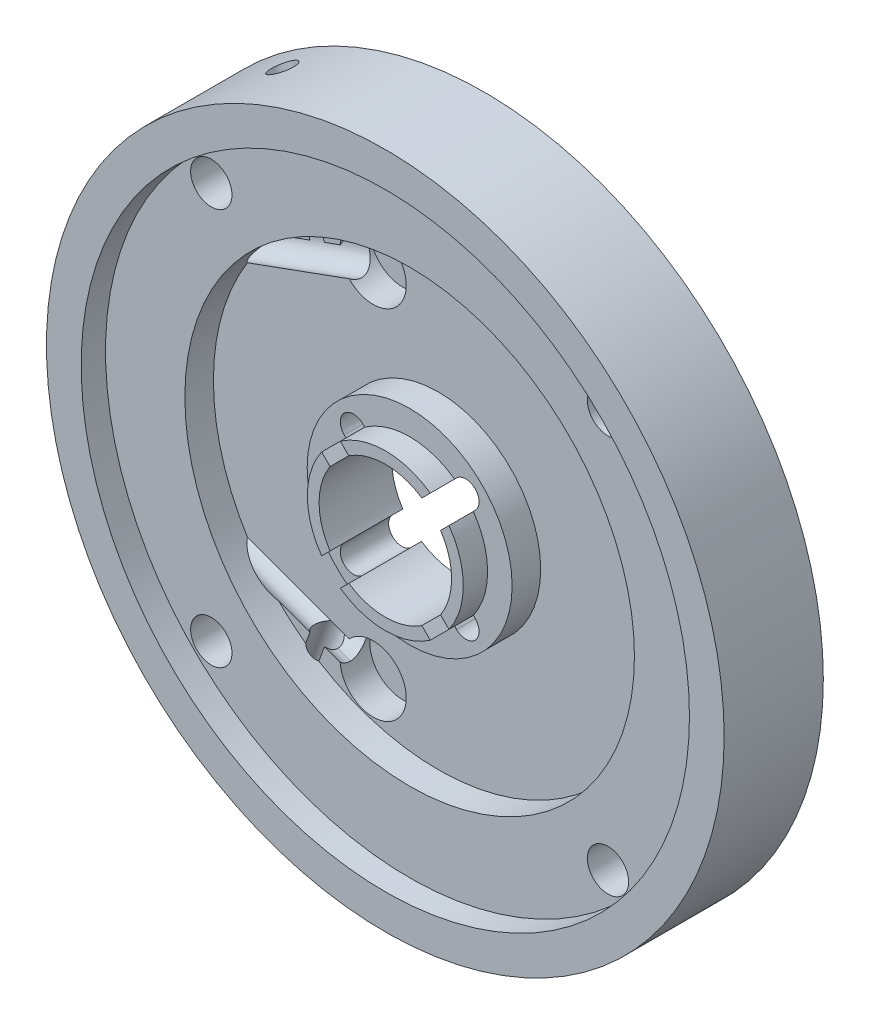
from build123d import *

# Parameters (mm, degrees)
F_3_8_16_TAPPED_HOLE1_D      = 7.9375
F_3_8_16_TAPPED_HOLE1_DEPTH  = 18.2499
F_3_8_16_TAPPED_HOLE1_TIP    = 2.384665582
SKETCH4_R                    = 4.79425
CUT_EXTRUDE1_DEPTH           = 6.35
CUT_EXTRUDE2_DEPTH           = 94.998233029
CIRPATTERN1_COUNT            = 4
SKETCH9_R                    = 6.35
CUT_EXTRUDE3_DEPTH           = 94.998233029
F_1_4_28_TAPPED_HOLE1_REACH  = 156.699
F_1_4_28_TAPPED_HOLE1_BORE_R = 3.175
F_10_32_TAPPED_HOLE1_REACH   = 156.699
F_10_32_TAPPED_HOLE1_BORE_R  = 2.413
F_1_4_28_TAPPED_HOLE2_REACH  = 156.699
F_1_4_28_TAPPED_HOLE2_BORE_R = 3.175
F_10_32_TAPPED_HOLE2_REACH   = 156.699
F_10_32_TAPPED_HOLE2_BORE_R  = 2.413
SKETCH20_R                   = 6.35
EXTRUDE1_DEPTH               = 3.175


with BuildPart() as part:
    # Sketch1 → Revolve1 (revolve)
    with BuildSketch(Plane(origin=(0, 0, 0), x_dir=(1, 0, 0), z_dir=(0, 1, 0))):
        Polygon((12.7254, 0), (12.7254, 13.97), (25.4, 13.97), (25.4, 19.05), (65.0875, 19.05), (65.0875, 0), (58.42, 0), (58.42, 4.6736), (43.18, 4.6736), (43.18, 10.16), (19.685, 10.16), (19.685, 4.6736), (14.97457, 4.6736), (14.97457, 0), align=None)
    revolve(axis=Axis((0, 0, 0), (0, 0, -1)))

    # 3_8-16 Tapped Hole1
    with Locations(Plane(origin=(0, 0, -19.05), x_dir=(-1, 0, 0), z_dir=(0, 0, -1))):
        with Locations((-38.1, 38.1), (38.1, 38.1), (38.1, -38.1), (-38.1, -38.1)):
            Hole(F_3_8_16_TAPPED_HOLE1_D / 2, depth=F_3_8_16_TAPPED_HOLE1_DEPTH)
            with Locations((0, 0, -(F_3_8_16_TAPPED_HOLE1_DEPTH + F_3_8_16_TAPPED_HOLE1_TIP / 2))):  # 118° drill point
                Cone(0, F_3_8_16_TAPPED_HOLE1_D / 2, F_3_8_16_TAPPED_HOLE1_TIP, mode=Mode.SUBTRACT)

    # Sketch4 → Cut-Extrude1 (cut)
    with BuildSketch(Plane(origin=(0, 0, -19.05), x_dir=(-1, 0, 0), z_dir=(0, 0, -1))):
        with Locations((0, 38.1)):
            Circle(SKETCH4_R)
        with Locations((38.1, 0)):
            Circle(SKETCH4_R)
        with Locations((0, -38.1)):
            Circle(SKETCH4_R)
        with Locations((-38.1, 0)):
            Circle(SKETCH4_R)
    extrude(amount=-CUT_EXTRUDE1_DEPTH, mode=Mode.SUBTRACT)

    # Sketch6 → Cut-Extrude2 (cut, through all)
    with BuildSketch(Plane(origin=(0, 0, -19.05), x_dir=(-1, 0, 0), z_dir=(0, 0, -1))):
        with BuildLine():
            Line((10.613199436, 7.021096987), (12.590319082, 8.998216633))
            ThreePointArc((12.590319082, 8.998216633), (12.590319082, 12.590319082), (8.998216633, 12.590319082))
            Line((8.998216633, 12.590319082), (7.021096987, 10.613199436))
            ThreePointArc((7.021096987, 10.613199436), (8.998216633, 8.998216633), (10.613199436, 7.021096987))
        make_face()
    cut_extrude2 = extrude(amount=-CUT_EXTRUDE2_DEPTH, mode=Mode.SUBTRACT)

    # CirPattern1: Cut-Extrude2 ×4 about axis
    cirpattern1_axis = Axis((0, 0, 0), (0, 0, 1))
    for i in range(1, CIRPATTERN1_COUNT):
        add(cut_extrude2.rotate(cirpattern1_axis, i * 360 / CIRPATTERN1_COUNT), mode=Mode.SUBTRACT)

    # Sketch9 → Cut-Extrude3 (cut, through all)
    with BuildSketch(Plane(origin=(0, 0, -19.05), x_dir=(-1, 0, 0), z_dir=(0, 0, -1))):
        with Locations((12.492354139, -34.322460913)):
            Circle(SKETCH9_R)
        with Locations(Location((12.492354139, 34.322460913, 0), (0, 0, 180))):
            Circle(SKETCH9_R)
    extrude(amount=-CUT_EXTRUDE3_DEPTH, mode=Mode.SUBTRACT)

    # 1_4-28 Tapped Hole1 bore → 1_4-28 Tapped Hole1 (cut, up to next)
    with BuildSketch(Plane(origin=(-61.162243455, 22.261236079, 0), x_dir=(-0.34202014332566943, -0.9396926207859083, 0), z_dir=(-0.9396926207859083, 0.34202014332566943, 0)), mode=Mode.PRIVATE) as f_1_4_28_tapped_hole1_sk1:
        with Locations((36.5252, -12.065)):
            Circle(F_1_4_28_TAPPED_HOLE1_BORE_R)
    f_1_4_28_tapped_hole1_tool1 = extrude(f_1_4_28_tapped_hole1_sk1.sketch, amount=-F_1_4_28_TAPPED_HOLE1_REACH, mode=Mode.PRIVATE) & part.part
    add(f_1_4_28_tapped_hole1_tool1.solids().sort_by_distance((-73.654598, -12.061225, -12.065))[0], mode=Mode.SUBTRACT)

    # 10-32 Tapped Hole1 bore → 10-32 Tapped Hole1 (cut, up to next)
    with BuildSketch(Plane(origin=(-22.261236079, -61.162243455, 0), x_dir=(0.9396926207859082, -0.3420201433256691, 0), z_dir=(-0.3420201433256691, -0.9396926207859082, 0)), mode=Mode.PRIVATE) as f_10_32_tapped_hole1_sk1:
        with Locations((-10.5156, -12.065)):
            Circle(F_10_32_TAPPED_HOLE1_BORE_R)
    f_10_32_tapped_hole1_tool1 = extrude(f_10_32_tapped_hole1_sk1.sketch, amount=-F_10_32_TAPPED_HOLE1_REACH, mode=Mode.PRIVATE) & part.part
    add(f_10_32_tapped_hole1_tool1.solids().sort_by_distance((-32.142668, -57.565696, -12.065))[0], mode=Mode.SUBTRACT)

    # 1_4-28 Tapped Hole2 bore → 1_4-28 Tapped Hole2 (cut, up to next)
    with BuildSketch(Plane(origin=(-61.162243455, -22.261236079, 0), x_dir=(0, 0, 1), z_dir=(-0.939692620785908, -0.3420201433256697, 0)), mode=Mode.PRIVATE) as f_1_4_28_tapped_hole2_sk1:
        with Locations((-12.065, 36.5252)):
            Circle(F_1_4_28_TAPPED_HOLE2_BORE_R)
    f_1_4_28_tapped_hole2_tool1 = extrude(f_1_4_28_tapped_hole2_sk1.sketch, amount=-F_1_4_28_TAPPED_HOLE2_REACH, mode=Mode.PRIVATE) & part.part
    add(f_1_4_28_tapped_hole2_tool1.solids().sort_by_distance((-73.654598, 12.061225, -12.065))[0], mode=Mode.SUBTRACT)

    # 10-32 Tapped Hole2 bore → 10-32 Tapped Hole2 (cut, up to next)
    with BuildSketch(Plane(origin=(-22.261236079, 61.162243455, 0), x_dir=(-0.9396926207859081, -0.34202014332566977, 0), z_dir=(-0.34202014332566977, 0.9396926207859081, 0)), mode=Mode.PRIVATE) as f_10_32_tapped_hole2_sk1:
        with Locations((10.5156, -12.065)):
            Circle(F_10_32_TAPPED_HOLE2_BORE_R)
    f_10_32_tapped_hole2_tool1 = extrude(f_10_32_tapped_hole2_sk1.sketch, amount=-F_10_32_TAPPED_HOLE2_REACH, mode=Mode.PRIVATE) & part.part
    add(f_10_32_tapped_hole2_tool1.solids().sort_by_distance((-32.142668, 57.565696, -12.065))[0], mode=Mode.SUBTRACT)

    # Sketch20 → Extrude1 (add)
    with BuildSketch(Plane(origin=(0, 0, -19.05), x_dir=(-1, 0, 0), z_dir=(0, 0, -1))):
        with Locations((12.492354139, -34.322460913)):
            Circle(SKETCH20_R)
        with Locations((12.492354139, 34.322460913)):
            Circle(SKETCH20_R)
    extrude(amount=-EXTRUDE1_DEPTH)


solid = part.part
